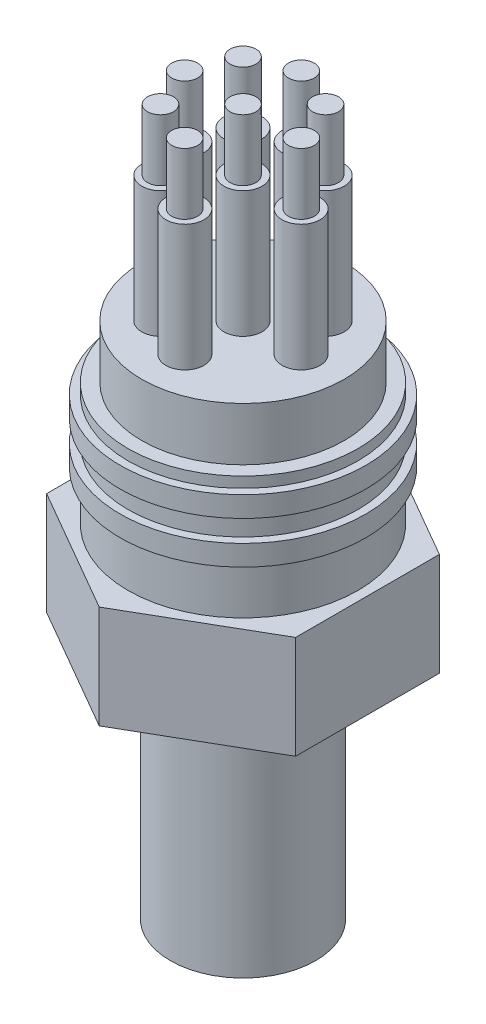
from build123d import *

# Parameters (mm, degrees)
EXTRUDE1_DEPTH    = 7.874
SKETCH3_R         = 7.747
EXTRUDE2_DEPTH    = 4.064
SKETCH4_R         = 1.4605
EXTRUDE3_DEPTH    = 9.652
SKETCH5_R         = 0.9906
EXTRUDE4_DEPTH    = 4.699
CIRPATTERN1_COUNT = 8
SKETCH_1_R        = 1.4605
EXTRUDE5_DEPTH    = 9.652
SKETCH_2_R        = 0.9906
EXTRUDE6_DEPTH    = 4.699
SKETCH8_R         = 5.55625
EXTRUDE7_DEPTH    = 18.28030303


with BuildPart() as part:
    # Sketch1 → Extrude1 (new body)
    with BuildSketch(Plane(origin=(0, 0, 0), x_dir=(1, 0, 0), z_dir=(0, 1, 0))):
        Polygon((0, 10.998522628), (-9.525, 5.499261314), (-9.525, -5.499261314), (0, -10.998522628), (9.525, -5.499261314), (9.525, 5.499261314), align=None)
    extrude(amount=EXTRUDE1_DEPTH)

    # Sketch2 → Revolve1 (revolve)
    with BuildSketch(Plane.XY, mode=Mode.PRIVATE) as revolve1_sk:
        Polygon((8.8011, 7.874), (8.8011, 11.6586), (9.398, 11.6586), (9.398, 13.2334), (8.8011, 13.2334), (8.8011, 14.8844), (9.398, 14.8844), (9.398, 16.4592), (8.8011, 16.4592), (8.8011, 17.272), (0, 17.272), (0, 7.874), align=None)
    revolve(revolve1_sk.sketch.rotate(Axis((0, 0, 0), (0, -1, 0)), 180), axis=Axis((0, 0, 0), (0, -1, 0)))

    # Sketch3 → Extrude2 (add)
    with BuildSketch(Plane(origin=(0, 17.272, 0), x_dir=(-1, 0, 0), z_dir=(0, 1, 0))):
        with Locations(Location((0, 0, 0), (0, 0, 180))):
            Circle(SKETCH3_R)
    extrude(amount=EXTRUDE2_DEPTH)

    # Sketch4 → Extrude3 (add)
    with BuildSketch(Plane(origin=(0, 21.336, 0), x_dir=(-1, 0, 0), z_dir=(0, 1, 0))):
        with Locations((0, -4.445)):
            Circle(SKETCH4_R)
    extrude3 = extrude(amount=EXTRUDE3_DEPTH)

    # Sketch5 → Extrude4 (add)
    with BuildSketch(Plane(origin=(0, 30.988, 0), x_dir=(-1, 0, 0), z_dir=(0, 1, 0))):
        with Locations((0, -4.463933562)):
            Circle(SKETCH5_R)
    extrude4 = extrude(amount=EXTRUDE4_DEPTH)

    # CirPattern1: Extrude3, Extrude4 ×8 about axis, 1 skipped
    cirpattern1_axis = Axis((0, 0, 0), (0, -1, 0))
    add([extrude3.rotate(cirpattern1_axis, i * 360 / CIRPATTERN1_COUNT) for i in range(1, CIRPATTERN1_COUNT) if i not in (3,)])
    add([extrude4.rotate(cirpattern1_axis, i * 360 / CIRPATTERN1_COUNT) for i in range(1, CIRPATTERN1_COUNT) if i not in (3,)])

    # Sketch 1 → Extrude5 (add)
    with BuildSketch(Plane(origin=(0.09953018, 21.336, 4.480198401), x_dir=(-1, 0, 0), z_dir=(0, 1, 0))):
        with Locations((0.09953018, -4.480198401)):
            Circle(SKETCH_1_R)
    extrude(amount=EXTRUDE5_DEPTH)

    # Sketch 2 → Extrude6 (add)
    with BuildSketch(Plane(origin=(0.09953018, 30.988, 4.480198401), x_dir=(-1, 0, 0), z_dir=(0, 1, 0))):
        with Locations((0.09953018, -4.480198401)):
            Circle(SKETCH_2_R)
    extrude(amount=EXTRUDE6_DEPTH)

    # Sketch8 → Extrude7 (add)
    with BuildSketch(Plane.XZ):
        with Locations(Location((0, 0, 0), (0, 0, 90))):
            Circle(SKETCH8_R)
    extrude(amount=EXTRUDE7_DEPTH)


solid = part.part
